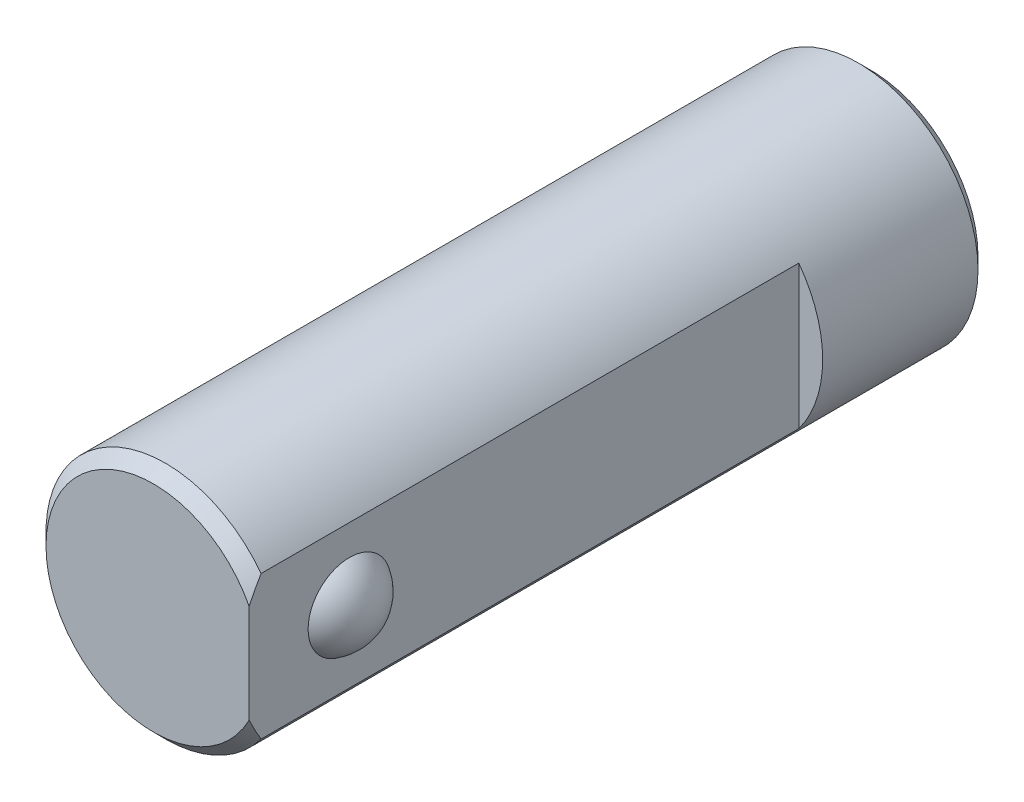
ISO-10303-21;
HEADER;
FILE_DESCRIPTION(('STEP AP214'),'2;1');
FILE_NAME('part.step','',(''),(''),'','','');
FILE_SCHEMA(('AUTOMOTIVE_DESIGN { 1 0 10303 214 1 1 1 1 }'));
ENDSEC;
DATA;
#1=APPLICATION_CONTEXT('core data for automotive mechanical design processes');
#2=APPLICATION_PROTOCOL_DEFINITION('international standard','automotive_design',2000,#1);
#3=PRODUCT_CONTEXT('',#1,'mechanical');
#4=PRODUCT('Part','Part','',(#3));
#5=PRODUCT_RELATED_PRODUCT_CATEGORY('part','',(#4));
#6=PRODUCT_DEFINITION_FORMATION('','',#4);
#7=PRODUCT_DEFINITION_CONTEXT('part definition',#1,'design');
#8=PRODUCT_DEFINITION('design','',#6,#7);
#9=PRODUCT_DEFINITION_SHAPE('','',#8);
#10=(LENGTH_UNIT() NAMED_UNIT(*) SI_UNIT(.MILLI.,.METRE.));
#11=(NAMED_UNIT(*) PLANE_ANGLE_UNIT() SI_UNIT($,.RADIAN.));
#12=(NAMED_UNIT(*) SI_UNIT($,.STERADIAN.) SOLID_ANGLE_UNIT());
#13=UNCERTAINTY_MEASURE_WITH_UNIT(LENGTH_MEASURE(1.E-05),#10,'distance_accuracy_value','');
#14=(GEOMETRIC_REPRESENTATION_CONTEXT(3) GLOBAL_UNCERTAINTY_ASSIGNED_CONTEXT((#13)) GLOBAL_UNIT_ASSIGNED_CONTEXT((#10,
#11,#12)) REPRESENTATION_CONTEXT('',''));
#15=CARTESIAN_POINT('',(0.,0.,0.));
#16=DIRECTION('',(0.,0.,1.));
#17=DIRECTION('',(1.,0.,0.));
#18=AXIS2_PLACEMENT_3D('',#15,#16,#17);
#19=CARTESIAN_POINT('',(4.,3.,7.));
#20=DIRECTION('',(-1.,0.,0.));
#21=DIRECTION('',(0.,0.,1.));
#22=AXIS2_PLACEMENT_3D('',#19,#20,#21);
#23=PLANE('',#22);
#24=DIRECTION('',(0.,-1.,0.));
#25=VECTOR('',#24,1.);
#26=CARTESIAN_POINT('',(4.,3.,30.));
#27=LINE('',#26,#25);
#28=CARTESIAN_POINT('',(4.,2.06155281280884,30.));
#29=VERTEX_POINT('',#28);
#30=CARTESIAN_POINT('',(4.,-2.06155281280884,30.));
#31=VERTEX_POINT('',#30);
#32=EDGE_CURVE('E54',#29,#31,#27,.T.);
#33=ORIENTED_EDGE('',*,*,#32,.T.);
#34=CARTESIAN_POINT('',(4.,-2.06155281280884,30.));
#35=CARTESIAN_POINT('',(4.,-2.14219323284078,29.9630496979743));
#36=CARTESIAN_POINT('',(4.,-2.2221801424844,29.9247002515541));
#37=CARTESIAN_POINT('',(4.,-2.38086486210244,29.8455639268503));
#38=CARTESIAN_POINT('',(4.,-2.45956360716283,29.8047789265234));
#39=CARTESIAN_POINT('',(4.,-2.61580254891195,29.7210803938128));
#40=CARTESIAN_POINT('',(4.,-2.6933428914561,29.6781671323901));
#41=CARTESIAN_POINT('',(4.,-2.84741921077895,29.5904380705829));
#42=CARTESIAN_POINT('',(4.,-2.92395437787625,29.5456208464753));
#43=CARTESIAN_POINT('',(4.,-3.,29.5));
#44=B_SPLINE_CURVE_WITH_KNOTS('',3,(#34,#35,#36,#37,#38,#39,#40,#41,#42,#43),.UNSPECIFIED.,.F.,
.F.,(4,2,2,2,4),(0.,0.266079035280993,0.531955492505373,0.797798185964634,1.0638432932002),.UNSPECIFIED.);
#45=CARTESIAN_POINT('',(4.,-3.,29.5));
#46=VERTEX_POINT('',#45);
#47=EDGE_CURVE('E37',#31,#46,#44,.T.);
#48=ORIENTED_EDGE('',*,*,#47,.T.);
#49=DIRECTION('',(0.,0.,1.));
#50=VECTOR('',#49,1.);
#51=CARTESIAN_POINT('',(4.,-3.,7.));
#52=LINE('',#51,#50);
#53=CARTESIAN_POINT('',(4.,-3.,7.));
#54=VERTEX_POINT('',#53);
#55=EDGE_CURVE('E59',#54,#46,#52,.T.);
#56=ORIENTED_EDGE('',*,*,#55,.F.);
#57=DIRECTION('',(0.,-1.,0.));
#58=VECTOR('',#57,1.);
#59=CARTESIAN_POINT('',(4.,3.,7.));
#60=LINE('',#59,#58);
#61=CARTESIAN_POINT('',(4.,3.,7.));
#62=VERTEX_POINT('',#61);
#63=EDGE_CURVE('E53',#62,#54,#60,.T.);
#64=ORIENTED_EDGE('',*,*,#63,.F.);
#65=DIRECTION('',(0.,0.,1.));
#66=VECTOR('',#65,1.);
#67=CARTESIAN_POINT('',(4.,3.,7.));
#68=LINE('',#67,#66);
#69=CARTESIAN_POINT('',(4.,3.,29.5));
#70=VERTEX_POINT('',#69);
#71=EDGE_CURVE('E57',#62,#70,#68,.T.);
#72=ORIENTED_EDGE('',*,*,#71,.T.);
#73=CARTESIAN_POINT('',(4.,3.,29.5));
#74=CARTESIAN_POINT('',(4.,2.92395437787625,29.5456208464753));
#75=CARTESIAN_POINT('',(4.,2.84741921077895,29.5904380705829));
#76=CARTESIAN_POINT('',(4.,2.6933428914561,29.6781671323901));
#77=CARTESIAN_POINT('',(4.,2.61580254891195,29.7210803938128));
#78=CARTESIAN_POINT('',(4.,2.45956360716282,29.8047789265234));
#79=CARTESIAN_POINT('',(4.,2.38086486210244,29.8455639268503));
#80=CARTESIAN_POINT('',(4.,2.2221801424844,29.9247002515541));
#81=CARTESIAN_POINT('',(4.,2.14219323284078,29.9630496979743));
#82=CARTESIAN_POINT('',(4.,2.06155281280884,30.));
#83=B_SPLINE_CURVE_WITH_KNOTS('',3,(#73,#74,#75,#76,#77,#78,#79,#80,#81,#82),.UNSPECIFIED.,.F.,
.F.,(4,2,2,2,4),(0.,0.266045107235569,0.531887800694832,0.797764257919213,1.0638432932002),.UNSPECIFIED.);
#84=EDGE_CURVE('E67',#70,#29,#83,.T.);
#85=ORIENTED_EDGE('',*,*,#84,.T.);
#86=EDGE_LOOP('',(#33,#48,#56,#64,#72,#85));
#87=FACE_BOUND('',#86,.T.);
#88=CARTESIAN_POINT('',(4.,0.,25.8));
#89=DIRECTION('',(-1.,0.,0.));
#90=DIRECTION('',(0.,0.,1.));
#91=AXIS2_PLACEMENT_3D('',#88,#89,#90);
#92=CIRCLE('',#91,1.73205080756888);
#93=CARTESIAN_POINT('',(4.,0.,27.5320508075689));
#94=VERTEX_POINT('',#93);
#95=EDGE_CURVE('E9',#94,#94,#92,.F.);
#96=ORIENTED_EDGE('',*,*,#95,.F.);
#97=EDGE_LOOP('',(#96));
#98=FACE_BOUND('',#97,.T.);
#99=ADVANCED_FACE('F14',(#87,#98),#23,.F.);
#100=CARTESIAN_POINT('',(0.,0.,0.));
#101=DIRECTION('',(0.,0.,1.));
#102=DIRECTION('',(1.,0.,0.));
#103=AXIS2_PLACEMENT_3D('',#100,#101,#102);
#104=CYLINDRICAL_SURFACE('',#103,5.);
#105=CARTESIAN_POINT('',(0.,0.,0.5));
#106=DIRECTION('',(0.,0.,1.));
#107=DIRECTION('',(1.,0.,0.));
#108=AXIS2_PLACEMENT_3D('',#105,#106,#107);
#109=CIRCLE('',#108,5.);
#110=CARTESIAN_POINT('',(5.,0.,0.5));
#111=VERTEX_POINT('',#110);
#112=EDGE_CURVE('E102',#111,#111,#109,.T.);
#113=ORIENTED_EDGE('',*,*,#112,.T.);
#114=EDGE_LOOP('',(#113));
#115=FACE_BOUND('',#114,.T.);
#116=ORIENTED_EDGE('',*,*,#55,.T.);
#117=CARTESIAN_POINT('',(0.,0.,29.5));
#118=DIRECTION('',(0.,0.,1.));
#119=DIRECTION('',(1.,0.,0.));
#120=AXIS2_PLACEMENT_3D('',#117,#118,#119);
#121=CIRCLE('',#120,5.);
#122=EDGE_CURVE('E29',#46,#70,#121,.F.);
#123=ORIENTED_EDGE('',*,*,#122,.T.);
#124=ORIENTED_EDGE('',*,*,#71,.F.);
#125=CARTESIAN_POINT('',(0.,0.,7.));
#126=DIRECTION('',(0.,0.,1.));
#127=DIRECTION('',(1.,0.,0.));
#128=AXIS2_PLACEMENT_3D('',#125,#126,#127);
#129=CIRCLE('',#128,5.);
#130=EDGE_CURVE('E50',#54,#62,#129,.T.);
#131=ORIENTED_EDGE('',*,*,#130,.F.);
#132=EDGE_LOOP('',(#116,#123,#124,#131));
#133=FACE_BOUND('',#132,.T.);
#134=ADVANCED_FACE('F16',(#115,#133),#104,.T.);
#135=CARTESIAN_POINT('',(0.,0.,0.));
#136=DIRECTION('',(0.,0.,1.));
#137=DIRECTION('',(1.,0.,0.));
#138=AXIS2_PLACEMENT_3D('',#135,#136,#137);
#139=PLANE('',#138);
#140=CARTESIAN_POINT('',(0.,0.,0.));
#141=DIRECTION('',(0.,0.,1.));
#142=DIRECTION('',(1.,0.,0.));
#143=AXIS2_PLACEMENT_3D('',#140,#141,#142);
#144=CIRCLE('',#143,4.5);
#145=CARTESIAN_POINT('',(4.5,0.,0.));
#146=VERTEX_POINT('',#145);
#147=EDGE_CURVE('E22',#146,#146,#144,.F.);
#148=ORIENTED_EDGE('',*,*,#147,.T.);
#149=EDGE_LOOP('',(#148));
#150=FACE_BOUND('',#149,.T.);
#151=ADVANCED_FACE('F90',(#150),#139,.F.);
#152=CARTESIAN_POINT('',(0.,0.,30.));
#153=DIRECTION('',(0.,0.,1.));
#154=DIRECTION('',(1.,0.,0.));
#155=AXIS2_PLACEMENT_3D('',#152,#153,#154);
#156=PLANE('',#155);
#157=ORIENTED_EDGE('',*,*,#32,.F.);
#158=CARTESIAN_POINT('',(0.,0.,30.));
#159=DIRECTION('',(0.,0.,1.));
#160=DIRECTION('',(1.,0.,0.));
#161=AXIS2_PLACEMENT_3D('',#158,#159,#160);
#162=CIRCLE('',#161,4.5);
#163=EDGE_CURVE('E62',#29,#31,#162,.T.);
#164=ORIENTED_EDGE('',*,*,#163,.T.);
#165=EDGE_LOOP('',(#157,#164));
#166=FACE_BOUND('',#165,.T.);
#167=ADVANCED_FACE('F87',(#166),#156,.T.);
#168=CARTESIAN_POINT('',(0.,0.,7.));
#169=DIRECTION('',(0.,0.,1.));
#170=DIRECTION('',(1.,0.,0.));
#171=AXIS2_PLACEMENT_3D('',#168,#169,#170);
#172=PLANE('',#171);
#173=ORIENTED_EDGE('',*,*,#130,.T.);
#174=ORIENTED_EDGE('',*,*,#63,.T.);
#175=EDGE_LOOP('',(#173,#174));
#176=FACE_BOUND('',#175,.T.);
#177=ADVANCED_FACE('F52',(#176),#172,.T.);
#178=CARTESIAN_POINT('',(0.,0.,30.));
#179=DIRECTION('',(0.,0.,-1.));
#180=DIRECTION('',(-1.,0.,0.));
#181=AXIS2_PLACEMENT_3D('',#178,#179,#180);
#182=CONICAL_SURFACE('',#181,4.5,0.785398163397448);
#183=ORIENTED_EDGE('',*,*,#84,.F.);
#184=ORIENTED_EDGE('',*,*,#122,.F.);
#185=ORIENTED_EDGE('',*,*,#47,.F.);
#186=ORIENTED_EDGE('',*,*,#163,.F.);
#187=EDGE_LOOP('',(#183,#184,#185,#186));
#188=FACE_BOUND('',#187,.T.);
#189=ADVANCED_FACE('F80',(#188),#182,.T.);
#190=CARTESIAN_POINT('',(0.,0.,0.5));
#191=DIRECTION('',(0.,0.,1.));
#192=DIRECTION('',(1.,0.,0.));
#193=AXIS2_PLACEMENT_3D('',#190,#191,#192);
#194=CONICAL_SURFACE('',#193,5.,0.785398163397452);
#195=ORIENTED_EDGE('',*,*,#147,.F.);
#196=EDGE_LOOP('',(#195));
#197=FACE_BOUND('',#196,.T.);
#198=ORIENTED_EDGE('',*,*,#112,.F.);
#199=EDGE_LOOP('',(#198));
#200=FACE_BOUND('',#199,.T.);
#201=ADVANCED_FACE('F107',(#197,#200),#194,.T.);
#202=CARTESIAN_POINT('',(3.,0.,25.8));
#203=DIRECTION('',(0.,0.,-1.));
#204=DIRECTION('',(0.,-1.,0.));
#205=AXIS2_PLACEMENT_3D('',#202,#203,#204);
#206=SPHERICAL_SURFACE('',#205,2.);
#207=CARTESIAN_POINT('',(3.,0.,25.8));
#208=DIRECTION('',(-1.,0.,0.));
#209=DIRECTION('',(0.,0.,1.));
#210=AXIS2_PLACEMENT_3D('',#207,#208,#209);
#211=SPHERICAL_SURFACE('',#210,2.);
#212=ORIENTED_EDGE('',*,*,#95,.T.);
#213=EDGE_LOOP('',(#212));
#214=FACE_BOUND('',#213,.T.);
#215=ADVANCED_FACE('F109',(#214),#211,.T.);
#216=CLOSED_SHELL('',(#99,#134,#151,#167,#177,#189,#201,#215));
#217=MANIFOLD_SOLID_BREP('B1',#216);
#218=ADVANCED_BREP_SHAPE_REPRESENTATION('',(#18,#217),#14);
#219=SHAPE_DEFINITION_REPRESENTATION(#9,#218);
ENDSEC;
END-ISO-10303-21;
